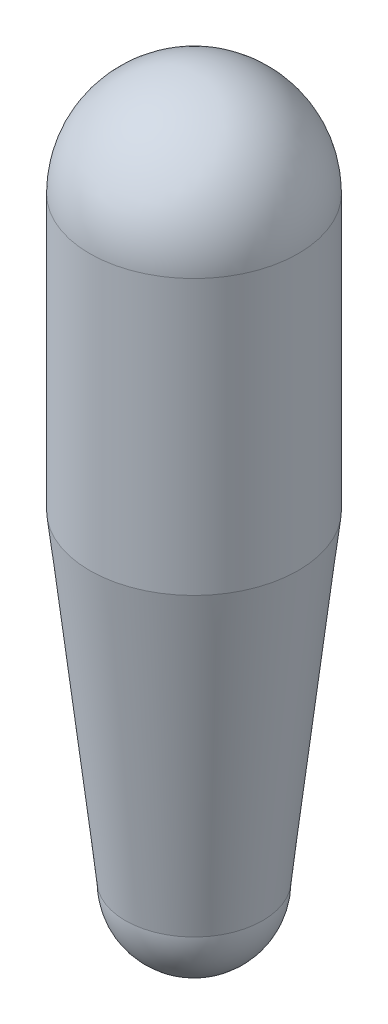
from build123d import *


with BuildPart() as part:
    # Sketch1 → Revolve1 (revolve)
    with BuildSketch(Plane.XY):
        with BuildLine():
            Line((-48.26, 0), (48.26, 0))
            ThreePointArc((48.26, 0), (0, 48.26), (-48.26, 0))
        make_face()
    revolve(axis=Axis((-48.26, 0, 0), (1, 0, 0)))


with BuildPart() as body_2:
    # Sketch2 → Revolve2 (revolve)
    with BuildSketch(Plane.XY):
        with BuildLine():
            Line((-31.75, -275.59), (31.75, -275.59))
            ThreePointArc((31.75, -275.59), (0, -307.34), (-31.75, -275.59))
        make_face()
    revolve(axis=Axis((-31.75, -275.59, 0), (1, 0, 0)))


with BuildPart() as part_1:
    add(part.part)

    add(body_2.part)  # Revolve3 merges body 2
    # Sketch3 → Revolve3 (revolve)
    with BuildSketch(Plane(origin=(0, 0, 0), x_dir=(0, 0, -1), z_dir=(1, 0, 0)), mode=Mode.PRIVATE) as revolve3_sk:
        Polygon((0, 0), (0, -275.59), (31.75, -275.59), (48.26, -127), (48.26, 0), align=None)
    revolve(revolve3_sk.sketch.rotate(Axis((0, 0, 0), (0, -1, 0)), 180), axis=Axis((0, 0, 0), (0, -1, 0)))


solid = part_1.part
